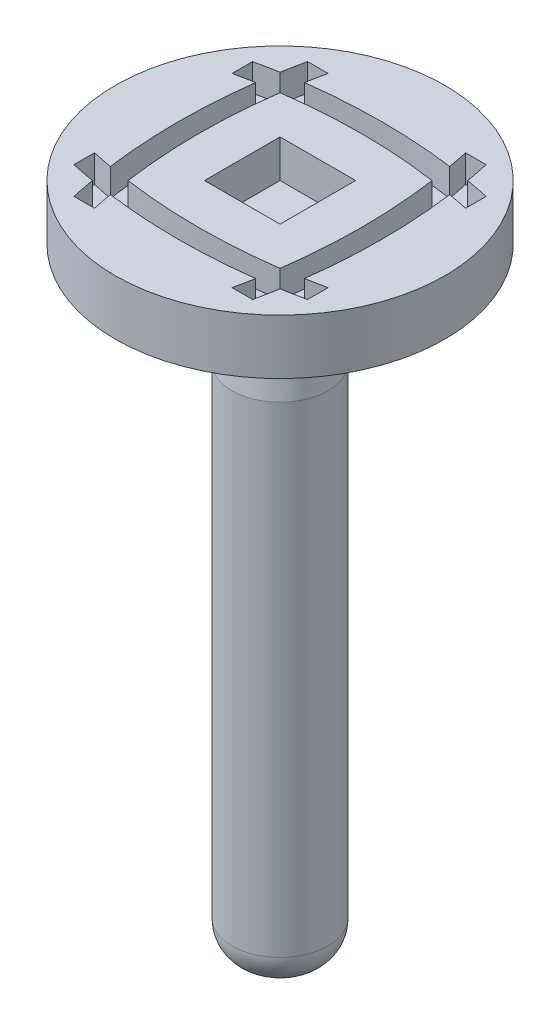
from build123d import *

# Parameters (mm, degrees)
SKETCH1_R           = 24
BOSS_EXTRUDE1_DEPTH = 8
SKETCH3_W           = 11
SKETCH3_H           = 11
CUT_EXTRUDE2_DEPTH  = 5.5
CUT_EXTRUDE6_DEPTH  = 4
FILLET1_R           = 5


with BuildPart() as part:
    # Sketch1 → Boss-Extrude1 (new body)
    with BuildSketch(Plane(origin=(0, 0, 0), x_dir=(1, 0, 0), z_dir=(0, 1, 0))):
        with Locations(Location((0, 0, 0), (0, 0, 270))):
            Circle(SKETCH1_R)
    extrude(amount=BOSS_EXTRUDE1_DEPTH)

    # Sketch3 → Cut-Extrude2 (cut)
    with BuildSketch(Plane(origin=(0, 8, 0), x_dir=(1, 0, 0), z_dir=(0, 1, 0))):
        Rectangle(SKETCH3_W, SKETCH3_H)
    extrude(amount=-CUT_EXTRUDE2_DEPTH, mode=Mode.SUBTRACT)

    # Sketch10 → Cut-Extrude6 (cut)
    with BuildSketch(Plane(origin=(0, 8, 0), x_dir=(1, 0, 0), z_dir=(0, 1, 0))):
        with BuildLine():
            Line((-17, 13), (-17, 10))
            ThreePointArc((-17, 10), (-15.565150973, 10.301241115), (-14.124974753, 10.575887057))
            ThreePointArc((-14.124974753, 10.575887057), (-14.827114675, 0), (-14.124974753, -10.575887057))
            ThreePointArc((-14.124974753, -10.575887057), (-15.565150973, -10.301241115), (-17, -10))
            Line((-17, -10), (-17, -13))
            ThreePointArc((-17, -13), (-15.330185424, -13.344535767), (-13.653407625, -13.653407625))
            ThreePointArc((-13.653407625, -13.653407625), (-13.344535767, -15.330185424), (-13, -17))
            Line((-13, -17), (-10, -17))
            ThreePointArc((-10, -17), (-10.301241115, -15.565150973), (-10.575887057, -14.124974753))
            ThreePointArc((-10.575887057, -14.124974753), (0, -14.827114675), (10.575887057, -14.124974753))
            ThreePointArc((10.575887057, -14.124974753), (10.301241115, -15.565150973), (10, -17))
            Line((10, -17), (13, -17))
            ThreePointArc((13, -17), (13.344535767, -15.330185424), (13.653407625, -13.653407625))
            ThreePointArc((13.653407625, -13.653407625), (15.330185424, -13.344535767), (17, -13))
            Line((17, -13), (17, -10))
            ThreePointArc((17, -10), (15.565150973, -10.301241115), (14.124974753, -10.575887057))
            ThreePointArc((14.124974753, -10.575887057), (14.827114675, 0), (14.124974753, 10.575887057))
            ThreePointArc((14.124974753, 10.575887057), (15.565150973, 10.301241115), (17, 10))
            Line((17, 10), (17, 13))
            ThreePointArc((17, 13), (15.330185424, 13.344535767), (13.653407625, 13.653407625))
            ThreePointArc((13.653407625, 13.653407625), (13.344535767, 15.330185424), (13, 17))
            Line((13, 17), (10, 17))
            ThreePointArc((10, 17), (10.301241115, 15.565150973), (10.575887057, 14.124974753))
            ThreePointArc((10.575887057, 14.124974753), (0, 14.827114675), (-10.575887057, 14.124974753))
            ThreePointArc((-10.575887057, 14.124974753), (-10.301241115, 15.565150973), (-10, 17))
            Line((-10, 17), (-13, 17))
            ThreePointArc((-13, 17), (-13.344535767, 15.330185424), (-13.653407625, 13.653407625))
            ThreePointArc((-13.653407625, 13.653407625), (-15.330185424, 13.344535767), (-17, 13))
        make_face()
        with BuildLine():
            ThreePointArc((-11.068117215, 11.068117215), (0, 11.844812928), (11.068117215, 11.068117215))
            ThreePointArc((11.068117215, 11.068117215), (11.844812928, 0), (11.068117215, -11.068117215))
            ThreePointArc((11.068117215, -11.068117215), (0, -11.844812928), (-11.068117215, -11.068117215))
            ThreePointArc((-11.068117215, -11.068117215), (-11.844812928, 0), (-11.068117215, 11.068117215))
        make_face(mode=Mode.SUBTRACT)
    extrude(amount=-CUT_EXTRUDE6_DEPTH, mode=Mode.SUBTRACT)

    # Sketch11 → Revolve1 (revolve)
    with BuildSketch(Plane.XY, mode=Mode.PRIVATE) as revolve1_sk:
        Polygon((0, 0), (0, -90), (7, -90), (7, -15), (5, 0), align=None)
    revolve(revolve1_sk.sketch.rotate(Axis((0, 0, 0), (0, -1, 0)), 180), axis=Axis((0, 0, 0), (0, -1, 0)))

    # Fillet1
    fillet1_edges = [part.edges().sort_by_distance(p)[0] for p in [
        (7, -90, 0),
    ]]
    fillet(fillet1_edges, radius=FILLET1_R)


solid = part.part
